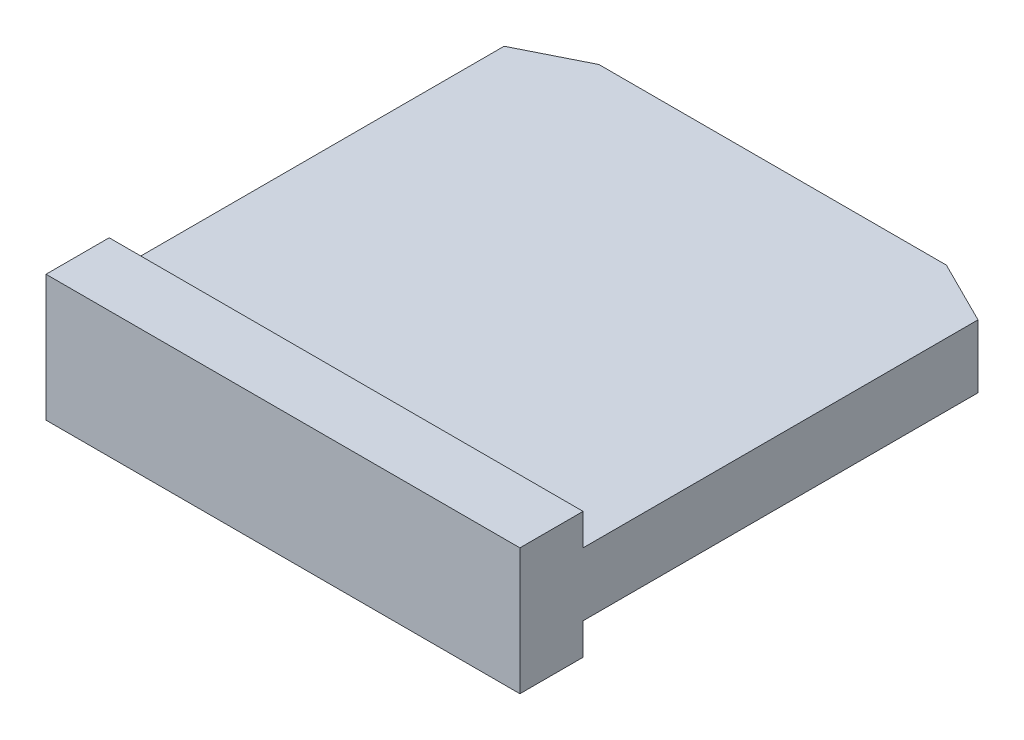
ISO-10303-21;
HEADER;
FILE_DESCRIPTION(('STEP AP214'),'2;1');
FILE_NAME('part.step','',(''),(''),'','','');
FILE_SCHEMA(('AUTOMOTIVE_DESIGN { 1 0 10303 214 1 1 1 1 }'));
ENDSEC;
DATA;
#1=APPLICATION_CONTEXT('core data for automotive mechanical design processes');
#2=APPLICATION_PROTOCOL_DEFINITION('international standard','automotive_design',2000,#1);
#3=PRODUCT_CONTEXT('',#1,'mechanical');
#4=PRODUCT('Part','Part','',(#3));
#5=PRODUCT_RELATED_PRODUCT_CATEGORY('part','',(#4));
#6=PRODUCT_DEFINITION_FORMATION('','',#4);
#7=PRODUCT_DEFINITION_CONTEXT('part definition',#1,'design');
#8=PRODUCT_DEFINITION('design','',#6,#7);
#9=PRODUCT_DEFINITION_SHAPE('','',#8);
#10=(LENGTH_UNIT() NAMED_UNIT(*) SI_UNIT(.MILLI.,.METRE.));
#11=(NAMED_UNIT(*) PLANE_ANGLE_UNIT() SI_UNIT($,.RADIAN.));
#12=(NAMED_UNIT(*) SI_UNIT($,.STERADIAN.) SOLID_ANGLE_UNIT());
#13=UNCERTAINTY_MEASURE_WITH_UNIT(LENGTH_MEASURE(1.E-05),#10,'distance_accuracy_value','');
#14=(GEOMETRIC_REPRESENTATION_CONTEXT(3) GLOBAL_UNCERTAINTY_ASSIGNED_CONTEXT((#13)) GLOBAL_UNIT_ASSIGNED_CONTEXT((#10,
#11,#12)) REPRESENTATION_CONTEXT('',''));
#15=CARTESIAN_POINT('',(0.,0.,0.));
#16=DIRECTION('',(0.,0.,1.));
#17=DIRECTION('',(1.,0.,0.));
#18=AXIS2_PLACEMENT_3D('',#15,#16,#17);
#19=CARTESIAN_POINT('',(15.,0.,15.5));
#20=DIRECTION('',(-1.,0.,0.));
#21=DIRECTION('',(0.,0.,1.));
#22=AXIS2_PLACEMENT_3D('',#19,#20,#21);
#23=PLANE('',#22);
#24=DIRECTION('',(0.,1.,0.));
#25=VECTOR('',#24,1.);
#26=CARTESIAN_POINT('',(15.,-11.5,0.999999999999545));
#27=LINE('',#26,#25);
#28=CARTESIAN_POINT('',(15.,1.,0.999999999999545));
#29=VERTEX_POINT('',#28);
#30=CARTESIAN_POINT('',(15.,3.,0.999999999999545));
#31=VERTEX_POINT('',#30);
#32=EDGE_CURVE('E49',#29,#31,#27,.T.);
#33=ORIENTED_EDGE('',*,*,#32,.T.);
#34=DIRECTION('',(0.,0.,1.));
#35=VECTOR('',#34,1.);
#36=CARTESIAN_POINT('',(15.,3.,13.5));
#37=LINE('',#36,#35);
#38=CARTESIAN_POINT('',(15.,3.,13.5));
#39=VERTEX_POINT('',#38);
#40=EDGE_CURVE('E122',#31,#39,#37,.T.);
#41=ORIENTED_EDGE('',*,*,#40,.T.);
#42=DIRECTION('',(0.,1.,0.));
#43=VECTOR('',#42,1.);
#44=CARTESIAN_POINT('',(15.,3.,13.5));
#45=LINE('',#44,#43);
#46=CARTESIAN_POINT('',(15.,4.,13.5));
#47=VERTEX_POINT('',#46);
#48=EDGE_CURVE('E132',#39,#47,#45,.T.);
#49=ORIENTED_EDGE('',*,*,#48,.T.);
#50=DIRECTION('',(0.,0.,-1.));
#51=VECTOR('',#50,1.);
#52=CARTESIAN_POINT('',(15.,4.,15.5));
#53=LINE('',#52,#51);
#54=CARTESIAN_POINT('',(15.,4.,15.5));
#55=VERTEX_POINT('',#54);
#56=EDGE_CURVE('E168',#55,#47,#53,.T.);
#57=ORIENTED_EDGE('',*,*,#56,.F.);
#58=DIRECTION('',(0.,1.,0.));
#59=VECTOR('',#58,1.);
#60=CARTESIAN_POINT('',(15.,0.,15.5));
#61=LINE('',#60,#59);
#62=CARTESIAN_POINT('',(15.,0.,15.5));
#63=VERTEX_POINT('',#62);
#64=EDGE_CURVE('E156',#63,#55,#61,.T.);
#65=ORIENTED_EDGE('',*,*,#64,.F.);
#66=DIRECTION('',(0.,0.,-1.));
#67=VECTOR('',#66,1.);
#68=CARTESIAN_POINT('',(15.,0.,15.5));
#69=LINE('',#68,#67);
#70=CARTESIAN_POINT('',(15.,0.,13.5));
#71=VERTEX_POINT('',#70);
#72=EDGE_CURVE('E171',#63,#71,#69,.T.);
#73=ORIENTED_EDGE('',*,*,#72,.T.);
#74=DIRECTION('',(0.,1.,0.));
#75=VECTOR('',#74,1.);
#76=CARTESIAN_POINT('',(15.,0.,13.5));
#77=LINE('',#76,#75);
#78=CARTESIAN_POINT('',(15.,1.,13.5));
#79=VERTEX_POINT('',#78);
#80=EDGE_CURVE('E134',#71,#79,#77,.T.);
#81=ORIENTED_EDGE('',*,*,#80,.T.);
#82=DIRECTION('',(0.,0.,-1.));
#83=VECTOR('',#82,1.);
#84=CARTESIAN_POINT('',(15.,1.,13.5));
#85=LINE('',#84,#83);
#86=EDGE_CURVE('E126',#79,#29,#85,.T.);
#87=ORIENTED_EDGE('',*,*,#86,.T.);
#88=EDGE_LOOP('',(#33,#41,#49,#57,#65,#73,#81,#87));
#89=FACE_BOUND('',#88,.T.);
#90=ADVANCED_FACE('F34',(#89),#23,.F.);
#91=CARTESIAN_POINT('',(0.,0.,15.5));
#92=DIRECTION('',(1.,0.,0.));
#93=DIRECTION('',(0.,0.,-1.));
#94=AXIS2_PLACEMENT_3D('',#91,#92,#93);
#95=PLANE('',#94);
#96=DIRECTION('',(0.,1.,0.));
#97=VECTOR('',#96,1.);
#98=CARTESIAN_POINT('',(0.,-11.5,0.999999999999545));
#99=LINE('',#98,#97);
#100=CARTESIAN_POINT('',(0.,1.,0.999999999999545));
#101=VERTEX_POINT('',#100);
#102=CARTESIAN_POINT('',(0.,3.,0.999999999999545));
#103=VERTEX_POINT('',#102);
#104=EDGE_CURVE('E117',#101,#103,#99,.T.);
#105=ORIENTED_EDGE('',*,*,#104,.F.);
#106=DIRECTION('',(0.,0.,-1.));
#107=VECTOR('',#106,1.);
#108=CARTESIAN_POINT('',(0.,1.,15.5));
#109=LINE('',#108,#107);
#110=CARTESIAN_POINT('',(0.,1.,13.5));
#111=VERTEX_POINT('',#110);
#112=EDGE_CURVE('E150',#111,#101,#109,.T.);
#113=ORIENTED_EDGE('',*,*,#112,.F.);
#114=DIRECTION('',(0.,1.,0.));
#115=VECTOR('',#114,1.);
#116=CARTESIAN_POINT('',(0.,0.,13.5));
#117=LINE('',#116,#115);
#118=CARTESIAN_POINT('',(0.,0.,13.5));
#119=VERTEX_POINT('',#118);
#120=EDGE_CURVE('E181',#119,#111,#117,.T.);
#121=ORIENTED_EDGE('',*,*,#120,.F.);
#122=DIRECTION('',(0.,0.,-1.));
#123=VECTOR('',#122,1.);
#124=CARTESIAN_POINT('',(0.,0.,15.5));
#125=LINE('',#124,#123);
#126=CARTESIAN_POINT('',(0.,0.,15.5));
#127=VERTEX_POINT('',#126);
#128=EDGE_CURVE('E162',#127,#119,#125,.T.);
#129=ORIENTED_EDGE('',*,*,#128,.F.);
#130=DIRECTION('',(0.,-1.,0.));
#131=VECTOR('',#130,1.);
#132=CARTESIAN_POINT('',(0.,0.,15.5));
#133=LINE('',#132,#131);
#134=CARTESIAN_POINT('',(0.,4.,15.5));
#135=VERTEX_POINT('',#134);
#136=EDGE_CURVE('E160',#135,#127,#133,.T.);
#137=ORIENTED_EDGE('',*,*,#136,.F.);
#138=DIRECTION('',(0.,0.,-1.));
#139=VECTOR('',#138,1.);
#140=CARTESIAN_POINT('',(0.,4.,15.5));
#141=LINE('',#140,#139);
#142=CARTESIAN_POINT('',(0.,4.,13.5));
#143=VERTEX_POINT('',#142);
#144=EDGE_CURVE('E165',#135,#143,#141,.T.);
#145=ORIENTED_EDGE('',*,*,#144,.T.);
#146=DIRECTION('',(0.,1.,0.));
#147=VECTOR('',#146,1.);
#148=CARTESIAN_POINT('',(0.,0.,13.5));
#149=LINE('',#148,#147);
#150=CARTESIAN_POINT('',(0.,3.,13.5));
#151=VERTEX_POINT('',#150);
#152=EDGE_CURVE('E179',#151,#143,#149,.T.);
#153=ORIENTED_EDGE('',*,*,#152,.F.);
#154=DIRECTION('',(0.,0.,1.));
#155=VECTOR('',#154,1.);
#156=CARTESIAN_POINT('',(0.,3.,15.5));
#157=LINE('',#156,#155);
#158=EDGE_CURVE('E142',#103,#151,#157,.T.);
#159=ORIENTED_EDGE('',*,*,#158,.F.);
#160=EDGE_LOOP('',(#105,#113,#121,#129,#137,#145,#153,#159));
#161=FACE_BOUND('',#160,.T.);
#162=ADVANCED_FACE('F196',(#161),#95,.F.);
#163=CARTESIAN_POINT('',(15.,0.,0.));
#164=DIRECTION('',(0.,0.,1.));
#165=DIRECTION('',(1.,0.,0.));
#166=AXIS2_PLACEMENT_3D('',#163,#164,#165);
#167=PLANE('',#166);
#168=DIRECTION('',(0.,1.,0.));
#169=VECTOR('',#168,1.);
#170=CARTESIAN_POINT('',(2.,-11.5,-4.54747350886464E-13));
#171=LINE('',#170,#169);
#172=CARTESIAN_POINT('',(2.,1.,0.));
#173=VERTEX_POINT('',#172);
#174=CARTESIAN_POINT('',(2.,3.,-4.54747350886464E-13));
#175=VERTEX_POINT('',#174);
#176=EDGE_CURVE('E57',#173,#175,#171,.T.);
#177=ORIENTED_EDGE('',*,*,#176,.T.);
#178=DIRECTION('',(-1.,0.,0.));
#179=VECTOR('',#178,1.);
#180=CARTESIAN_POINT('',(15.,3.,0.));
#181=LINE('',#180,#179);
#182=CARTESIAN_POINT('',(13.,3.,-4.54747350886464E-13));
#183=VERTEX_POINT('',#182);
#184=EDGE_CURVE('E174',#183,#175,#181,.T.);
#185=ORIENTED_EDGE('',*,*,#184,.F.);
#186=DIRECTION('',(0.,1.,0.));
#187=VECTOR('',#186,1.);
#188=CARTESIAN_POINT('',(13.,-11.5,-4.54747350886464E-13));
#189=LINE('',#188,#187);
#190=CARTESIAN_POINT('',(13.,1.,-4.54747350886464E-13));
#191=VERTEX_POINT('',#190);
#192=EDGE_CURVE('E111',#191,#183,#189,.T.);
#193=ORIENTED_EDGE('',*,*,#192,.F.);
#194=DIRECTION('',(1.,0.,0.));
#195=VECTOR('',#194,1.);
#196=CARTESIAN_POINT('',(15.,1.,0.));
#197=LINE('',#196,#195);
#198=EDGE_CURVE('E176',#173,#191,#197,.T.);
#199=ORIENTED_EDGE('',*,*,#198,.F.);
#200=EDGE_LOOP('',(#177,#185,#193,#199));
#201=FACE_BOUND('',#200,.T.);
#202=ADVANCED_FACE('F187',(#201),#167,.F.);
#203=CARTESIAN_POINT('',(-0.5,3.,13.5));
#204=DIRECTION('',(0.,1.,0.));
#205=DIRECTION('',(0.,0.,1.));
#206=AXIS2_PLACEMENT_3D('',#203,#204,#205);
#207=PLANE('',#206);
#208=ORIENTED_EDGE('',*,*,#184,.T.);
#209=DIRECTION('',(-0.894427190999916,0.,0.447213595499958));
#210=VECTOR('',#209,1.);
#211=CARTESIAN_POINT('',(-5.40000000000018,3.,3.69999999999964));
#212=LINE('',#211,#210);
#213=EDGE_CURVE('E116',#175,#103,#212,.T.);
#214=ORIENTED_EDGE('',*,*,#213,.T.);
#215=ORIENTED_EDGE('',*,*,#158,.T.);
#216=DIRECTION('',(1.,0.,0.));
#217=VECTOR('',#216,1.);
#218=CARTESIAN_POINT('',(-0.5,3.,13.5));
#219=LINE('',#218,#217);
#220=EDGE_CURVE('E130',#151,#39,#219,.T.);
#221=ORIENTED_EDGE('',*,*,#220,.T.);
#222=ORIENTED_EDGE('',*,*,#40,.F.);
#223=DIRECTION('',(-0.894427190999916,0.,-0.447213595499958));
#224=VECTOR('',#223,1.);
#225=CARTESIAN_POINT('',(7.60000000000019,3.,-2.70000000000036));
#226=LINE('',#225,#224);
#227=EDGE_CURVE('E108',#31,#183,#226,.T.);
#228=ORIENTED_EDGE('',*,*,#227,.T.);
#229=EDGE_LOOP('',(#208,#214,#215,#221,#222,#228));
#230=FACE_BOUND('',#229,.T.);
#231=ADVANCED_FACE('F128',(#230),#207,.T.);
#232=CARTESIAN_POINT('',(-0.5,1.,13.5));
#233=DIRECTION('',(0.,-1.,0.));
#234=DIRECTION('',(0.,0.,-1.));
#235=AXIS2_PLACEMENT_3D('',#232,#233,#234);
#236=PLANE('',#235);
#237=ORIENTED_EDGE('',*,*,#112,.T.);
#238=DIRECTION('',(0.894427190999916,0.,-0.447213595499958));
#239=VECTOR('',#238,1.);
#240=CARTESIAN_POINT('',(-5.40000000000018,1.,3.69999999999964));
#241=LINE('',#240,#239);
#242=EDGE_CURVE('E12',#101,#173,#241,.T.);
#243=ORIENTED_EDGE('',*,*,#242,.T.);
#244=ORIENTED_EDGE('',*,*,#198,.T.);
#245=DIRECTION('',(0.894427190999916,0.,0.447213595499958));
#246=VECTOR('',#245,1.);
#247=CARTESIAN_POINT('',(7.60000000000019,1.,-2.70000000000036));
#248=LINE('',#247,#246);
#249=EDGE_CURVE('E42',#191,#29,#248,.T.);
#250=ORIENTED_EDGE('',*,*,#249,.T.);
#251=ORIENTED_EDGE('',*,*,#86,.F.);
#252=DIRECTION('',(1.,0.,0.));
#253=VECTOR('',#252,1.);
#254=CARTESIAN_POINT('',(-0.5,1.,13.5));
#255=LINE('',#254,#253);
#256=EDGE_CURVE('E140',#111,#79,#255,.T.);
#257=ORIENTED_EDGE('',*,*,#256,.F.);
#258=EDGE_LOOP('',(#237,#243,#244,#250,#251,#257));
#259=FACE_BOUND('',#258,.T.);
#260=ADVANCED_FACE('F183',(#259),#236,.T.);
#261=CARTESIAN_POINT('',(0.,0.,15.5));
#262=DIRECTION('',(0.,1.,0.));
#263=DIRECTION('',(0.,0.,1.));
#264=AXIS2_PLACEMENT_3D('',#261,#262,#263);
#265=PLANE('',#264);
#266=DIRECTION('',(1.,0.,0.));
#267=VECTOR('',#266,1.);
#268=CARTESIAN_POINT('',(-0.5,0.,13.5));
#269=LINE('',#268,#267);
#270=EDGE_CURVE('E143',#119,#71,#269,.T.);
#271=ORIENTED_EDGE('',*,*,#270,.T.);
#272=ORIENTED_EDGE('',*,*,#72,.F.);
#273=DIRECTION('',(1.,0.,0.));
#274=VECTOR('',#273,1.);
#275=CARTESIAN_POINT('',(0.,0.,15.5));
#276=LINE('',#275,#274);
#277=EDGE_CURVE('E153',#127,#63,#276,.T.);
#278=ORIENTED_EDGE('',*,*,#277,.F.);
#279=ORIENTED_EDGE('',*,*,#128,.T.);
#280=EDGE_LOOP('',(#271,#272,#278,#279));
#281=FACE_BOUND('',#280,.T.);
#282=ADVANCED_FACE('F36',(#281),#265,.F.);
#283=CARTESIAN_POINT('',(0.,4.,15.5));
#284=DIRECTION('',(0.,-1.,0.));
#285=DIRECTION('',(0.,0.,-1.));
#286=AXIS2_PLACEMENT_3D('',#283,#284,#285);
#287=PLANE('',#286);
#288=DIRECTION('',(1.,0.,0.));
#289=VECTOR('',#288,1.);
#290=CARTESIAN_POINT('',(-0.5,4.,13.5));
#291=LINE('',#290,#289);
#292=EDGE_CURVE('E146',#143,#47,#291,.T.);
#293=ORIENTED_EDGE('',*,*,#292,.F.);
#294=ORIENTED_EDGE('',*,*,#144,.F.);
#295=DIRECTION('',(-1.,0.,0.));
#296=VECTOR('',#295,1.);
#297=CARTESIAN_POINT('',(0.,4.,15.5));
#298=LINE('',#297,#296);
#299=EDGE_CURVE('E158',#55,#135,#298,.T.);
#300=ORIENTED_EDGE('',*,*,#299,.F.);
#301=ORIENTED_EDGE('',*,*,#56,.T.);
#302=EDGE_LOOP('',(#293,#294,#300,#301));
#303=FACE_BOUND('',#302,.T.);
#304=ADVANCED_FACE('F204',(#303),#287,.F.);
#305=CARTESIAN_POINT('',(15.,0.,15.5));
#306=DIRECTION('',(0.,0.,1.));
#307=DIRECTION('',(1.,0.,0.));
#308=AXIS2_PLACEMENT_3D('',#305,#306,#307);
#309=PLANE('',#308);
#310=ORIENTED_EDGE('',*,*,#277,.T.);
#311=ORIENTED_EDGE('',*,*,#64,.T.);
#312=ORIENTED_EDGE('',*,*,#299,.T.);
#313=ORIENTED_EDGE('',*,*,#136,.T.);
#314=EDGE_LOOP('',(#310,#311,#312,#313));
#315=FACE_BOUND('',#314,.T.);
#316=ADVANCED_FACE('F210',(#315),#309,.T.);
#317=CARTESIAN_POINT('',(-0.5,3.,13.5));
#318=DIRECTION('',(0.,0.,-1.));
#319=DIRECTION('',(-1.,0.,0.));
#320=AXIS2_PLACEMENT_3D('',#317,#318,#319);
#321=PLANE('',#320);
#322=ORIENTED_EDGE('',*,*,#152,.T.);
#323=ORIENTED_EDGE('',*,*,#292,.T.);
#324=ORIENTED_EDGE('',*,*,#48,.F.);
#325=ORIENTED_EDGE('',*,*,#220,.F.);
#326=EDGE_LOOP('',(#322,#323,#324,#325));
#327=FACE_BOUND('',#326,.T.);
#328=ADVANCED_FACE('F202',(#327),#321,.T.);
#329=CARTESIAN_POINT('',(-0.5,0.,13.5));
#330=DIRECTION('',(0.,0.,-1.));
#331=DIRECTION('',(-1.,0.,0.));
#332=AXIS2_PLACEMENT_3D('',#329,#330,#331);
#333=PLANE('',#332);
#334=ORIENTED_EDGE('',*,*,#120,.T.);
#335=ORIENTED_EDGE('',*,*,#256,.T.);
#336=ORIENTED_EDGE('',*,*,#80,.F.);
#337=ORIENTED_EDGE('',*,*,#270,.F.);
#338=EDGE_LOOP('',(#334,#335,#336,#337));
#339=FACE_BOUND('',#338,.T.);
#340=ADVANCED_FACE('F215',(#339),#333,.T.);
#341=CARTESIAN_POINT('',(13.,-11.5,-4.54747350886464E-13));
#342=DIRECTION('',(0.447213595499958,0.,-0.894427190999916));
#343=DIRECTION('',(-0.894427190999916,0.,-0.447213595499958));
#344=AXIS2_PLACEMENT_3D('',#341,#342,#343);
#345=PLANE('',#344);
#346=ORIENTED_EDGE('',*,*,#32,.F.);
#347=ORIENTED_EDGE('',*,*,#249,.F.);
#348=ORIENTED_EDGE('',*,*,#192,.T.);
#349=ORIENTED_EDGE('',*,*,#227,.F.);
#350=EDGE_LOOP('',(#346,#347,#348,#349));
#351=FACE_BOUND('',#350,.T.);
#352=ADVANCED_FACE('F109',(#351),#345,.T.);
#353=CARTESIAN_POINT('',(0.,-11.5,0.999999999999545));
#354=DIRECTION('',(-0.447213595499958,0.,-0.894427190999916));
#355=DIRECTION('',(-0.894427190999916,0.,0.447213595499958));
#356=AXIS2_PLACEMENT_3D('',#353,#354,#355);
#357=PLANE('',#356);
#358=ORIENTED_EDGE('',*,*,#176,.F.);
#359=ORIENTED_EDGE('',*,*,#242,.F.);
#360=ORIENTED_EDGE('',*,*,#104,.T.);
#361=ORIENTED_EDGE('',*,*,#213,.F.);
#362=EDGE_LOOP('',(#358,#359,#360,#361));
#363=FACE_BOUND('',#362,.T.);
#364=ADVANCED_FACE('F216',(#363),#357,.T.);
#365=CLOSED_SHELL('',(#90,#162,#202,#231,#260,#282,#304,#316,#328,#340,#352,#364));
#366=MANIFOLD_SOLID_BREP('B2',#365);
#367=ADVANCED_BREP_SHAPE_REPRESENTATION('',(#18,#366),#14);
#368=SHAPE_DEFINITION_REPRESENTATION(#9,#367);
ENDSEC;
END-ISO-10303-21;
